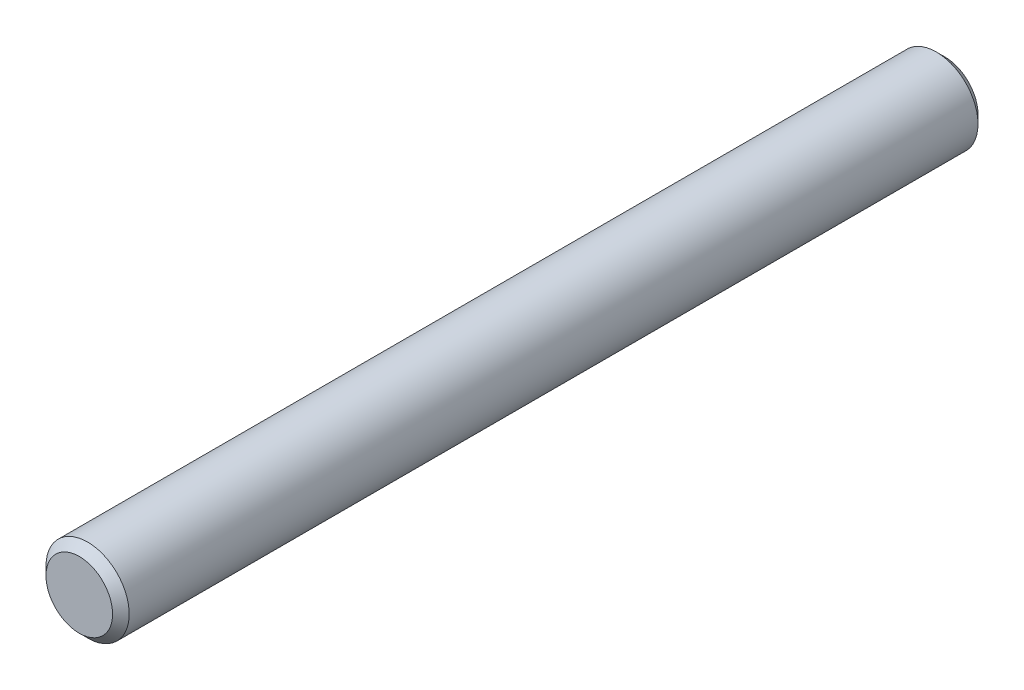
ISO-10303-21;
HEADER;
FILE_DESCRIPTION(('STEP AP214'),'2;1');
FILE_NAME('part.step','',(''),(''),'','','');
FILE_SCHEMA(('AUTOMOTIVE_DESIGN { 1 0 10303 214 1 1 1 1 }'));
ENDSEC;
DATA;
#1=APPLICATION_CONTEXT('core data for automotive mechanical design processes');
#2=APPLICATION_PROTOCOL_DEFINITION('international standard','automotive_design',2000,#1);
#3=PRODUCT_CONTEXT('',#1,'mechanical');
#4=PRODUCT('Part','Part','',(#3));
#5=PRODUCT_RELATED_PRODUCT_CATEGORY('part','',(#4));
#6=PRODUCT_DEFINITION_FORMATION('','',#4);
#7=PRODUCT_DEFINITION_CONTEXT('part definition',#1,'design');
#8=PRODUCT_DEFINITION('design','',#6,#7);
#9=PRODUCT_DEFINITION_SHAPE('','',#8);
#10=(LENGTH_UNIT() NAMED_UNIT(*) SI_UNIT(.MILLI.,.METRE.));
#11=(NAMED_UNIT(*) PLANE_ANGLE_UNIT() SI_UNIT($,.RADIAN.));
#12=(NAMED_UNIT(*) SI_UNIT($,.STERADIAN.) SOLID_ANGLE_UNIT());
#13=UNCERTAINTY_MEASURE_WITH_UNIT(LENGTH_MEASURE(1.E-05),#10,'distance_accuracy_value','');
#14=(GEOMETRIC_REPRESENTATION_CONTEXT(3) GLOBAL_UNCERTAINTY_ASSIGNED_CONTEXT((#13)) GLOBAL_UNIT_ASSIGNED_CONTEXT((#10,
#11,#12)) REPRESENTATION_CONTEXT('',''));
#15=CARTESIAN_POINT('',(0.,0.,0.));
#16=DIRECTION('',(0.,0.,1.));
#17=DIRECTION('',(1.,0.,0.));
#18=AXIS2_PLACEMENT_3D('',#15,#16,#17);
#19=CARTESIAN_POINT('',(0.,0.,52.));
#20=DIRECTION('',(0.,0.,-1.));
#21=DIRECTION('',(-1.,0.,0.));
#22=AXIS2_PLACEMENT_3D('',#19,#20,#21);
#23=CYLINDRICAL_SURFACE('',#22,2.5);
#24=CARTESIAN_POINT('',(0.,0.,51.5));
#25=DIRECTION('',(0.,0.,1.));
#26=DIRECTION('',(1.,0.,0.));
#27=AXIS2_PLACEMENT_3D('',#24,#25,#26);
#28=CIRCLE('',#27,2.5);
#29=CARTESIAN_POINT('',(-2.5,0.,51.5));
#30=VERTEX_POINT('',#29);
#31=EDGE_CURVE('E40',#30,#30,#28,.F.);
#32=CARTESIAN_POINT('',(0.,0.,0.500000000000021));
#33=DIRECTION('',(0.,0.,1.));
#34=DIRECTION('',(1.,0.,0.));
#35=AXIS2_PLACEMENT_3D('',#32,#33,#34);
#36=CIRCLE('',#35,2.5);
#37=CARTESIAN_POINT('',(-2.5,0.,0.500000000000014));
#38=VERTEX_POINT('',#37);
#39=EDGE_CURVE('E44',#38,#38,#36,.T.);
#40=CARTESIAN_POINT('',(-2.5,0.,51.5));
#41=CARTESIAN_POINT('',(-2.5,0.,50.96875));
#42=CARTESIAN_POINT('',(-2.5,0.,50.4375));
#43=CARTESIAN_POINT('',(-2.5,0.,49.375));
#44=CARTESIAN_POINT('',(-2.5,0.,48.84375));
#45=CARTESIAN_POINT('',(-2.5,0.,47.78125));
#46=CARTESIAN_POINT('',(-2.5,0.,47.25));
#47=CARTESIAN_POINT('',(-2.5,0.,46.1875));
#48=CARTESIAN_POINT('',(-2.5,0.,45.65625));
#49=CARTESIAN_POINT('',(-2.5,0.,44.59375));
#50=CARTESIAN_POINT('',(-2.5,0.,44.0625));
#51=CARTESIAN_POINT('',(-2.5,0.,43.));
#52=CARTESIAN_POINT('',(-2.5,0.,42.46875));
#53=CARTESIAN_POINT('',(-2.5,0.,41.40625));
#54=CARTESIAN_POINT('',(-2.5,0.,40.875));
#55=CARTESIAN_POINT('',(-2.5,0.,39.8125));
#56=CARTESIAN_POINT('',(-2.5,0.,39.28125));
#57=CARTESIAN_POINT('',(-2.5,0.,38.21875));
#58=CARTESIAN_POINT('',(-2.5,0.,37.6875));
#59=CARTESIAN_POINT('',(-2.5,0.,36.625));
#60=CARTESIAN_POINT('',(-2.5,0.,36.09375));
#61=CARTESIAN_POINT('',(-2.5,0.,35.03125));
#62=CARTESIAN_POINT('',(-2.5,0.,34.5));
#63=CARTESIAN_POINT('',(-2.5,0.,33.4375));
#64=CARTESIAN_POINT('',(-2.5,0.,32.90625));
#65=CARTESIAN_POINT('',(-2.5,0.,31.84375));
#66=CARTESIAN_POINT('',(-2.5,0.,31.3125));
#67=CARTESIAN_POINT('',(-2.5,0.,30.25));
#68=CARTESIAN_POINT('',(-2.5,0.,29.71875));
#69=CARTESIAN_POINT('',(-2.5,0.,28.65625));
#70=CARTESIAN_POINT('',(-2.5,0.,28.125));
#71=CARTESIAN_POINT('',(-2.5,0.,27.0625));
#72=CARTESIAN_POINT('',(-2.5,0.,26.53125));
#73=CARTESIAN_POINT('',(-2.5,0.,25.46875));
#74=CARTESIAN_POINT('',(-2.5,0.,24.9375));
#75=CARTESIAN_POINT('',(-2.5,0.,23.875));
#76=CARTESIAN_POINT('',(-2.5,0.,23.34375));
#77=CARTESIAN_POINT('',(-2.5,0.,22.28125));
#78=CARTESIAN_POINT('',(-2.5,0.,21.75));
#79=CARTESIAN_POINT('',(-2.5,0.,20.6875));
#80=CARTESIAN_POINT('',(-2.5,0.,20.15625));
#81=CARTESIAN_POINT('',(-2.5,0.,19.09375));
#82=CARTESIAN_POINT('',(-2.5,0.,18.5625));
#83=CARTESIAN_POINT('',(-2.5,0.,17.5));
#84=CARTESIAN_POINT('',(-2.5,0.,16.96875));
#85=CARTESIAN_POINT('',(-2.5,0.,15.90625));
#86=CARTESIAN_POINT('',(-2.5,0.,15.375));
#87=CARTESIAN_POINT('',(-2.5,0.,14.3125));
#88=CARTESIAN_POINT('',(-2.5,0.,13.78125));
#89=CARTESIAN_POINT('',(-2.5,0.,12.71875));
#90=CARTESIAN_POINT('',(-2.5,0.,12.1875));
#91=CARTESIAN_POINT('',(-2.5,0.,11.125));
#92=CARTESIAN_POINT('',(-2.5,0.,10.59375));
#93=CARTESIAN_POINT('',(-2.5,0.,9.53125000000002));
#94=CARTESIAN_POINT('',(-2.5,0.,9.00000000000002));
#95=CARTESIAN_POINT('',(-2.5,0.,7.93750000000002));
#96=CARTESIAN_POINT('',(-2.5,0.,7.40625000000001));
#97=CARTESIAN_POINT('',(-2.5,0.,6.34375000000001));
#98=CARTESIAN_POINT('',(-2.5,0.,5.81250000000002));
#99=CARTESIAN_POINT('',(-2.5,0.,4.75000000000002));
#100=CARTESIAN_POINT('',(-2.5,0.,4.21875000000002));
#101=CARTESIAN_POINT('',(-2.5,0.,3.15625000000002));
#102=CARTESIAN_POINT('',(-2.5,0.,2.62500000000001));
#103=CARTESIAN_POINT('',(-2.5,0.,1.56250000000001));
#104=CARTESIAN_POINT('',(-2.5,0.,1.03125000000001));
#105=CARTESIAN_POINT('',(-2.5,0.,0.500000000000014));
#106=B_SPLINE_CURVE_WITH_KNOTS('',3,(#40,#41,#42,#43,#44,#45,#46,#47,#48,#49,#50,#51,#52,#53,
#54,#55,#56,#57,#58,#59,#60,#61,#62,#63,#64,#65,#66,#67,#68,#69,#70,#71,#72,#73,#74,#75,#76,#77,
#78,#79,#80,#81,#82,#83,#84,#85,#86,#87,#88,#89,#90,#91,#92,#93,#94,#95,#96,#97,#98,#99,#100,
#101,#102,#103,#104,#105),.UNSPECIFIED.,.F.,.F.,(4,2,2,2,2,2,2,2,2,2,2,2,2,2,2,2,2,2,2,2,2,2,2,
2,2,2,2,2,2,2,2,2,4),(0.,1.59375,3.1875,4.78124999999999,6.375,7.96875,9.56249999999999,
11.15625,12.75,14.34375,15.9375,17.53125,19.125,20.71875,22.3125,23.90625,25.5,27.09375,28.6875,
30.28125,31.875,33.46875,35.0625,36.65625,38.25,39.84375,41.4375,43.03125,44.625,46.21875,
47.8125,49.40625,51.),.UNSPECIFIED.);
#107=EDGE_CURVE('BSEAM33',#30,#38,#106,.T.);
#108=ORIENTED_EDGE('',*,*,#31,.T.);
#109=ORIENTED_EDGE('',*,*,#39,.T.);
#110=ORIENTED_EDGE('',*,*,#107,.T.);
#111=ORIENTED_EDGE('',*,*,#107,.F.);
#112=EDGE_LOOP('',(#108,#110,#109,#111));
#113=FACE_BOUND('',#112,.T.);
#114=ADVANCED_FACE('F33',(#113),#23,.T.);
#115=CARTESIAN_POINT('',(0.,0.,52.));
#116=DIRECTION('',(0.,0.,1.));
#117=DIRECTION('',(1.,0.,0.));
#118=AXIS2_PLACEMENT_3D('',#115,#116,#117);
#119=PLANE('',#118);
#120=CARTESIAN_POINT('',(0.,0.,52.));
#121=DIRECTION('',(0.,0.,1.));
#122=DIRECTION('',(1.,0.,0.));
#123=AXIS2_PLACEMENT_3D('',#120,#121,#122);
#124=CIRCLE('',#123,2.00000000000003);
#125=CARTESIAN_POINT('',(2.00000000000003,0.,52.));
#126=VERTEX_POINT('',#125);
#127=EDGE_CURVE('E48',#126,#126,#124,.T.);
#128=ORIENTED_EDGE('',*,*,#127,.T.);
#129=EDGE_LOOP('',(#128));
#130=FACE_BOUND('',#129,.T.);
#131=ADVANCED_FACE('F54',(#130),#119,.T.);
#132=CARTESIAN_POINT('',(0.,0.,0.));
#133=DIRECTION('',(0.,0.,1.));
#134=DIRECTION('',(1.,0.,0.));
#135=AXIS2_PLACEMENT_3D('',#132,#133,#134);
#136=PLANE('',#135);
#137=CARTESIAN_POINT('',(0.,0.,0.));
#138=DIRECTION('',(0.,0.,1.));
#139=DIRECTION('',(1.,0.,0.));
#140=AXIS2_PLACEMENT_3D('',#137,#138,#139);
#141=CIRCLE('',#140,1.99999999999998);
#142=CARTESIAN_POINT('',(1.99999999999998,0.,0.));
#143=VERTEX_POINT('',#142);
#144=EDGE_CURVE('E10',#143,#143,#141,.F.);
#145=ORIENTED_EDGE('',*,*,#144,.T.);
#146=EDGE_LOOP('',(#145));
#147=FACE_BOUND('',#146,.T.);
#148=ADVANCED_FACE('F58',(#147),#136,.F.);
#149=CARTESIAN_POINT('',(0.,0.,52.));
#150=DIRECTION('',(0.,0.,-1.));
#151=DIRECTION('',(-1.,0.,0.));
#152=AXIS2_PLACEMENT_3D('',#149,#150,#151);
#153=CONICAL_SURFACE('',#152,2.00000000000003,0.78539816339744);
#154=ORIENTED_EDGE('',*,*,#31,.F.);
#155=EDGE_LOOP('',(#154));
#156=FACE_BOUND('',#155,.T.);
#157=ORIENTED_EDGE('',*,*,#127,.F.);
#158=EDGE_LOOP('',(#157));
#159=FACE_BOUND('',#158,.T.);
#160=ADVANCED_FACE('F56',(#156,#159),#153,.T.);
#161=CARTESIAN_POINT('',(0.,0.,0.500000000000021));
#162=DIRECTION('',(0.,0.,1.));
#163=DIRECTION('',(1.,0.,0.));
#164=AXIS2_PLACEMENT_3D('',#161,#162,#163);
#165=CONICAL_SURFACE('',#164,2.5,0.785398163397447);
#166=ORIENTED_EDGE('',*,*,#144,.F.);
#167=EDGE_LOOP('',(#166));
#168=FACE_BOUND('',#167,.T.);
#169=ORIENTED_EDGE('',*,*,#39,.F.);
#170=EDGE_LOOP('',(#169));
#171=FACE_BOUND('',#170,.T.);
#172=ADVANCED_FACE('F35',(#168,#171),#165,.T.);
#173=CLOSED_SHELL('',(#114,#131,#148,#160,#172));
#174=MANIFOLD_SOLID_BREP('B2',#173);
#175=ADVANCED_BREP_SHAPE_REPRESENTATION('',(#18,#174),#14);
#176=SHAPE_DEFINITION_REPRESENTATION(#9,#175);
ENDSEC;
END-ISO-10303-21;
